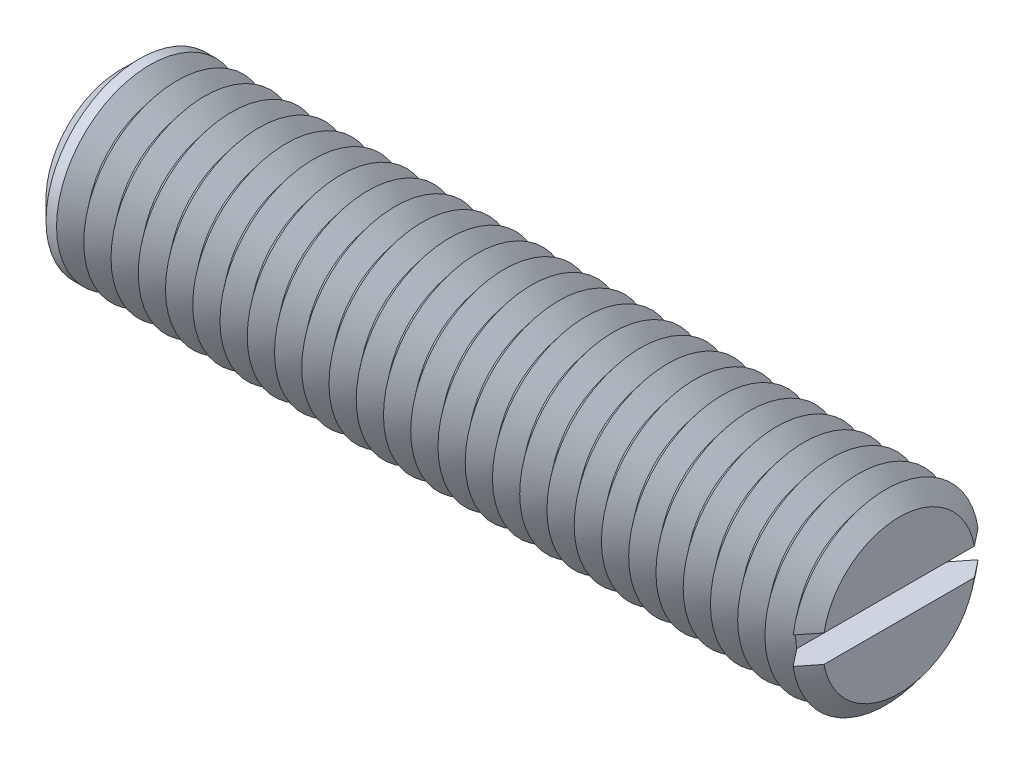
from build123d import *

# Parameters (mm, degrees)
SKETCH1_R       = 6
EXTRUDE1_DEPTH  = 25
SKETCH2_W       = 1.75
SKETCH2_H       = 1.75
EXTRUDE2_DEPTH  = 9
CHAMFER1_SIZE   = 1.2
LPATTERN1_COUNT = 28
LPATTERN1_PITCH = 1.75


with BuildPart() as part:
    # Sketch1 → Extrude1 (new, symmetric)
    with BuildSketch(Plane(origin=(0, 0, 0), x_dir=(0, 0, -1), z_dir=(1, 0, 0))):
        Circle(SKETCH1_R)
    extrude(amount=EXTRUDE1_DEPTH, both=True)

    # Sketch2 → Extrude2 (cut, symmetric)
    with BuildSketch(Plane.XY):
        with Locations((24.125, 0)):
            Rectangle(SKETCH2_W, SKETCH2_H)
    extrude(amount=EXTRUDE2_DEPTH, both=True, mode=Mode.SUBTRACT)

    # Chamfer1
    chamfer1_edges = [part.edges().sort_by_distance(p)[0] for p in [
        (-25, 0, 6),
    ]]
    chamfer(chamfer1_edges, length=CHAMFER1_SIZE)

    # Sketch3 → Cut-Revolve1 (revolve, cut)
    with BuildSketch(Plane.XY, mode=Mode.PRIVATE) as cut_revolve1_sk:
        Polygon((24.125, -6), (25.875, -6), (25, -4.90712535), align=None)
    cut_revolve1 = revolve(cut_revolve1_sk.sketch.rotate(Axis((0, 0, 0), (1, 0, 0)), 261.614461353), axis=Axis((0, 0, 0), (1, 0, 0)), mode=Mode.SUBTRACT)

    # LPattern1: Cut-Revolve1 ×28
    with Locations(*[(-i * LPATTERN1_PITCH, 0, 0) for i in range(1, LPATTERN1_COUNT)]):
        add(cut_revolve1, mode=Mode.SUBTRACT)


solid = part.part
